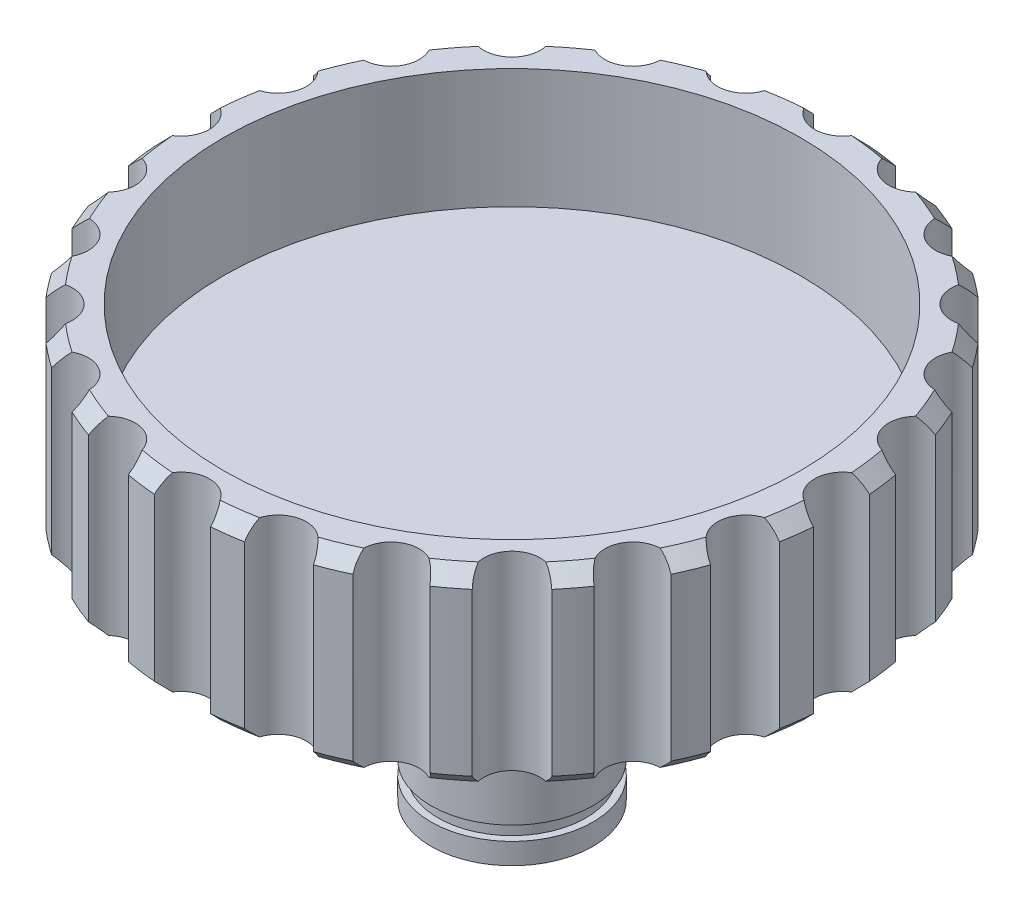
from build123d import *

# Parameters (mm, degrees)
SKETCH1_R                 = 23.5
BOSS_EXTRUDE1_DEPTH       = 13.5
CHAMFER1_SIZE             = 1
SKETCH3_R                 = 2
CUT_EXTRUDE1_DEPTH        = 36.871297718
CIRPATTERN1_COUNT         = 24
SKETCH4_R                 = 20.5
CANDLE_BORE_DEPTH         = 8.5
SKETCH5_R                 = 5.75
BOSS_EXTRUDE2_DEPTH       = 17
SKETCH6_W                 = 3
SKETCH6_H                 = 1
M6X1_0_TAPPED_HOLE1_D     = 5
M6X1_0_TAPPED_HOLE1_DEPTH = 19
M6X1_0_TAPPED_HOLE1_TIP   = 1.502151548


with BuildPart() as part:
    # Sketch1 → Boss-Extrude1 (new body)
    with BuildSketch(Plane(origin=(0, 0, 0), x_dir=(1, 0, 0), z_dir=(0, 1, 0))):
        with Locations(Location((0, 0, 0), (0, 0, 270))):
            Circle(SKETCH1_R)
    extrude(amount=-BOSS_EXTRUDE1_DEPTH)

    # Chamfer1
    chamfer1_edges = [part.edges().sort_by_distance(p)[0] for p in [
        (0, 0, -23.5),
        (0, -13.5, -23.5),
    ]]
    chamfer(chamfer1_edges, length=CHAMFER1_SIZE)

    # Sketch3 → Cut-Extrude1 (cut, through all)
    with BuildSketch(Plane(origin=(0, 0, 0), x_dir=(1, 0, 0), z_dir=(0, 1, 0))):
        with Locations((-23.5, 0)):
            Circle(SKETCH3_R)
    cut_extrude1 = extrude(amount=-CUT_EXTRUDE1_DEPTH, mode=Mode.SUBTRACT)

    # CirPattern1: Cut-Extrude1 ×24 about axis
    cirpattern1_axis = Axis((0, 0, 0), (0, 1, 0))
    for i in range(1, CIRPATTERN1_COUNT):
        add(cut_extrude1.rotate(cirpattern1_axis, i * 360 / CIRPATTERN1_COUNT), mode=Mode.SUBTRACT)

    # Sketch4 → Candle Bore (cut)
    with BuildSketch(Plane(origin=(0, 0, 0), x_dir=(1, 0, 0), z_dir=(0, 1, 0))):
        with Locations(Location((0, 0, 0), (0, 0, 270))):
            Circle(SKETCH4_R)
    extrude(amount=-CANDLE_BORE_DEPTH, mode=Mode.SUBTRACT)

    # Sketch5 → Boss-Extrude2 (add)
    with BuildSketch(Plane.XZ.offset(13.5)):
        with Locations(Location((0, 0, 0), (0, 0, 90))):
            Circle(SKETCH5_R)
    extrude(amount=BOSS_EXTRUDE2_DEPTH)

    # Sketch6 → O-ring groove (revolve, cut)
    with BuildSketch(Plane(origin=(0, 0, 0), x_dir=(0, 0, -1), z_dir=(1, 0, 0))):
        with Locations((-6.75, -28.5)):
            Rectangle(SKETCH6_W, SKETCH6_H)
    revolve(axis=Axis((0, -30.5, 0), (0, 1, 0)), mode=Mode.SUBTRACT)

    # M6x1.0 Tapped Hole1
    with Locations(Plane(origin=(0, -30.5, 0), x_dir=(-1, 0, 0), z_dir=(0, -1, 0))):
        with Locations((0, 0)):
            Hole(M6X1_0_TAPPED_HOLE1_D / 2, depth=M6X1_0_TAPPED_HOLE1_DEPTH)
            with Locations((0, 0, -(M6X1_0_TAPPED_HOLE1_DEPTH + M6X1_0_TAPPED_HOLE1_TIP / 2))):  # 118° drill point
                Cone(0, M6X1_0_TAPPED_HOLE1_D / 2, M6X1_0_TAPPED_HOLE1_TIP, mode=Mode.SUBTRACT)


solid = part.part
